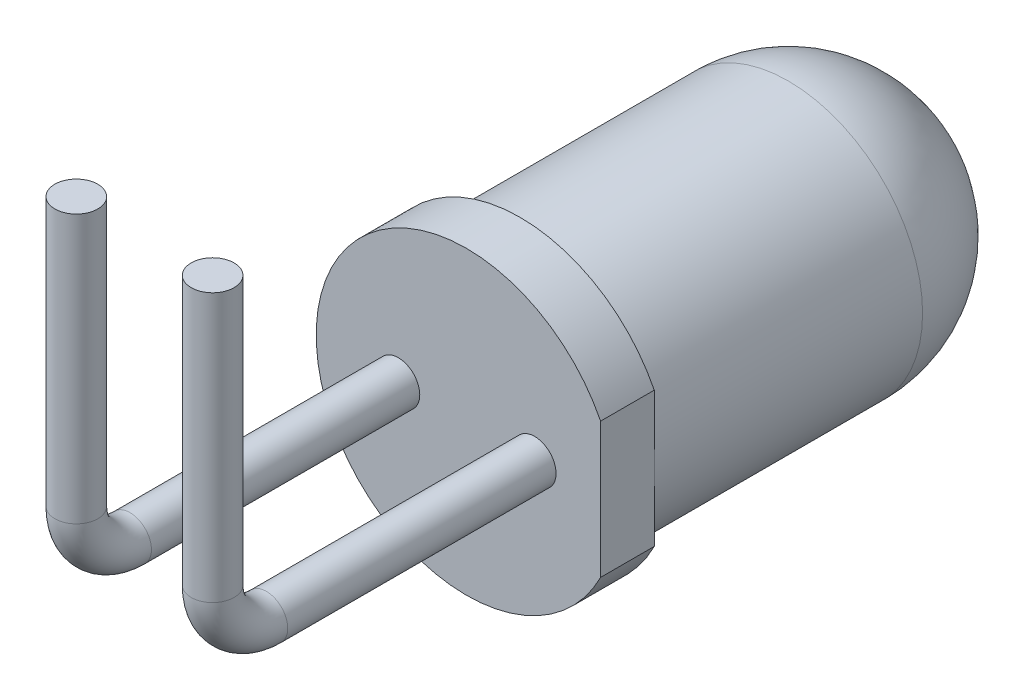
from build123d import *

# Parameters (mm, degrees)
ESQUISSE1_R          = 2.5
BASE_EXTRUSION_DEPTH = 8.5
BOSS_EXTRU_1_DEPTH   = 1
CONG_1_R             = 2.5
ESQUISSE3_R          = 0.4


with BuildPart() as part:
    # Esquisse1 → Base-Extrusion (new body)
    with BuildSketch(Plane.XY):
        Circle(ESQUISSE1_R)
    extrude(amount=BASE_EXTRUSION_DEPTH)

    # Esquisse2 → Boss.-Extru.1 (add)
    with BuildSketch(Plane.XY.offset(8.5)):
        with BuildLine():
            Line((2.5, 1.260952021), (2.5, -1.260952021))
            ThreePointArc((2.5, -1.260952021), (-2.8, 0), (2.5, 1.260952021))
        make_face()
    extrude(amount=-BOSS_EXTRU_1_DEPTH)

    # Cong_1
    cong_1_edges = [part.edges().sort_by_distance(p)[0] for p in [
        (-2.5, 0, 0),
    ]]
    fillet(cong_1_edges, radius=CONG_1_R)

    # Balayage1: sweep along a path in Esquisse5
    with BuildLine(Plane(origin=(1.27, 0, 0), x_dir=(0, 0, -1), z_dir=(1, 0, 0))) as balayage1_path:
        Line((-8.5, 0), (-13.5, 0))
        ThreePointArc((-13.5, 0), (-14.207106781, 0.292893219), (-14.5, 1))
        Line((-14.5, 1), (-14.5, 6))
    # Esquisse3 → Balayage1 (sweep)
    with BuildSketch(Plane.XY.offset(8.5)):
        with Locations((1.27, 0)):
            Circle(ESQUISSE3_R)
    balayage1 = sweep(path=balayage1_path.line)

    # Sym_trie1: Balayage1 across plane
    add(balayage1.mirror(Plane(origin=(0, 0, 0), x_dir=(0, 0, 1), z_dir=(1, 0, 0))))


solid = part.part
